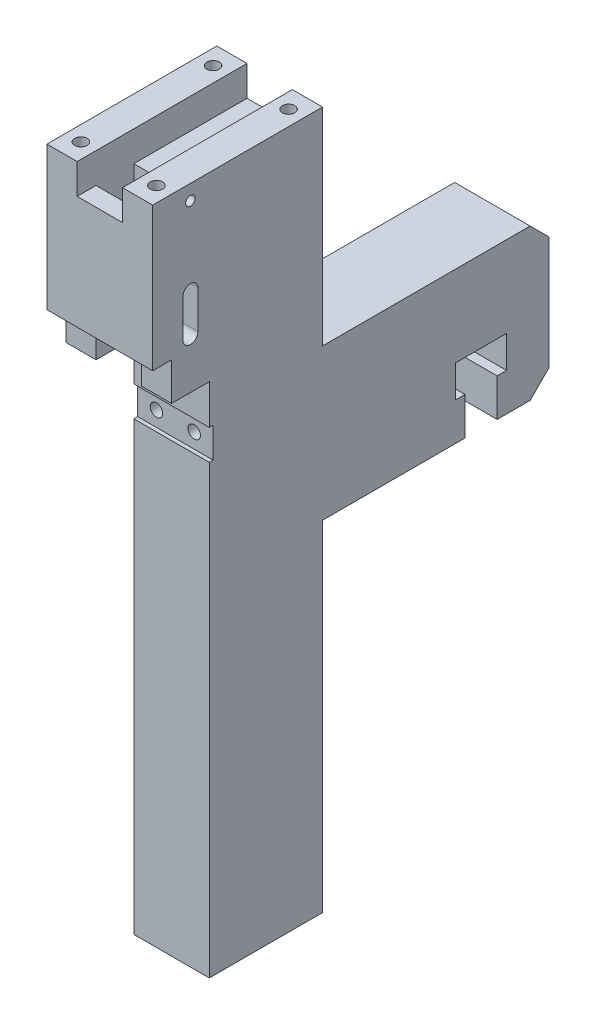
from build123d import *

# Parameters (mm, degrees)
EXTRUDE_1_DEPTH      = 105
SKETCH_2_OUTSIDE_W   = 149.876
SKETCH_2_OUTSIDE_H   = 229.676
CUT_EXTRUDE_1_DEPTH  = 105
CUT_EXTRUDE_2_DEPTH  = 14
SKETCH_4_R           = 1.25
CUT_EXTRUDE_3_DEPTH  = 14
SKETCH_8_R           = 1.65
CUT_EXTRUDE_8_DEPTH  = 15
SKETCH_9_R           = 1.65
CUT_EXTRUDE_9_DEPTH  = 15
SKETCH_11_R          = 2.1
CUT_EXTRUDE_10_DEPTH = 15
SKETCH_13_W          = 12
SKETCH_13_H          = 10
CUT_EXTRUDE_11_DEPTH = 208.526480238


with BuildPart() as part:
    # Sketch 1 → Extrude 1 (new body)
    with BuildSketch(Plane.XY):
        Polygon((8, 0), (8, 136.8), (0, 136.8), (0, 184.8), (8, 184.8), (8, 176.8), (20, 176.8), (20, 184.8), (28, 184.8), (28, 0), align=None)
    extrude(amount=EXTRUDE_1_DEPTH)

    # Sketch 2 outside → Cut-Extrude 1 (cut)
    with BuildSketch(Plane(origin=(28, 0, 0), x_dir=(0, 0, -1), z_dir=(1, 0, 0))):
        with Locations((-52.5, 92.4)):
            Rectangle(SKETCH_2_OUTSIDE_W, SKETCH_2_OUTSIDE_H)
        Polygon((-105, 146.8), (-100, 146.8), (-100, 136.8), (-90, 136.8), (-90, 126.3), (-89, 126.3), (-89, 118.3), (-90, 118.3), (-90, 0), (-60, 0), (-60, 90), (-22.25, 90), (-22.25, 100), (-24.75, 100), (-24.75, 108.5), (-11.25, 108.5), (-11.25, 100), (-13.75, 100), (-13.75, 90), (-5, 90), (0, 95), (0, 125), (-5, 130), (-60, 130), (-60, 184.8), (-105, 184.8), align=None, mode=Mode.SUBTRACT)
    extrude(amount=-CUT_EXTRUDE_1_DEPTH, mode=Mode.SUBTRACT)

    # Sketch 3 → Cut-Extrude 2 (cut)
    with BuildSketch(Plane(origin=(28, 0, 0), x_dir=(0, 0, -1), z_dir=(1, 0, 0))):
        with BuildLine():
            Line((-97, 149.8), (-97, 159.8))
            ThreePointArc((-97, 159.8), (-95, 161.8), (-93, 159.8))
            Line((-93, 159.8), (-93, 149.8))
            ThreePointArc((-93, 149.8), (-95, 147.8), (-97, 149.8))
        make_face()
    extrude(amount=-CUT_EXTRUDE_2_DEPTH, mode=Mode.SUBTRACT)

    # Sketch 4 → Cut-Extrude 3 (cut)
    with BuildSketch(Plane(origin=(28, 0, 0), x_dir=(0, 0, -1), z_dir=(1, 0, 0))):
        with Locations((-95, 180.8)):
            Circle(SKETCH_4_R)
    extrude(amount=-CUT_EXTRUDE_3_DEPTH, mode=Mode.SUBTRACT)

    # Sketch 8 → Cut-Extrude 8 (cut)
    with BuildSketch(Plane.XY.offset(89)):
        with Locations((13, 122.3)):
            Circle(SKETCH_8_R)
        with Locations((23, 122.3)):
            Circle(SKETCH_8_R)
    extrude(amount=-CUT_EXTRUDE_8_DEPTH, mode=Mode.SUBTRACT)

    # Sketch 9 → Cut-Extrude 9 (cut)
    with BuildSketch(Plane(origin=(0, 184.8, 0), x_dir=(1, 0, 0), z_dir=(0, 1, 0))):
        with Locations(Location((4, -65, 0), (0, 0, 270))):
            Circle(SKETCH_9_R)
        with Locations(Location((24, -65, 0), (0, 0, 270))):
            Circle(SKETCH_9_R)
        with Locations(Location((24, -100, 0), (0, 0, 270))):
            Circle(SKETCH_9_R)
        with Locations(Location((4, -100, 0), (0, 0, 270))):
            Circle(SKETCH_9_R)
    extrude(amount=-CUT_EXTRUDE_9_DEPTH, mode=Mode.SUBTRACT)

    # Sketch 11 → Cut-Extrude 10 (cut)
    with BuildSketch(Plane(origin=(0, 0, 60), x_dir=(-1, 0, 0), z_dir=(0, 0, -1))):
        with Locations((-23, 156.3)):
            Circle(SKETCH_11_R)
        with Locations((-5, 156.3)):
            Circle(SKETCH_11_R)
    extrude(amount=-CUT_EXTRUDE_10_DEPTH, mode=Mode.SUBTRACT)

    # Sketch 13 → Cut-Extrude 11 (cut, through all)
    with BuildSketch(Plane(origin=(0, 176.8, 0), x_dir=(1, 0, 0), z_dir=(0, 1, 0))):
        with Locations((14, -95)):
            Rectangle(SKETCH_13_W, SKETCH_13_H)
    extrude(amount=-CUT_EXTRUDE_11_DEPTH, mode=Mode.SUBTRACT)


solid = part.part
